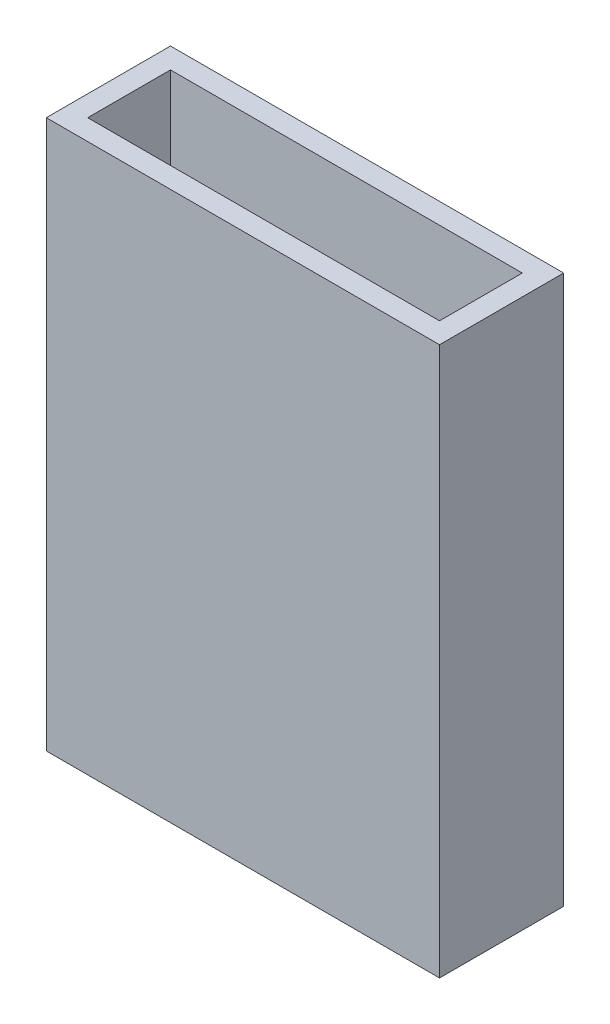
ISO-10303-21;
HEADER;
FILE_DESCRIPTION(('STEP AP214'),'2;1');
FILE_NAME('part.step','',(''),(''),'','','');
FILE_SCHEMA(('AUTOMOTIVE_DESIGN { 1 0 10303 214 1 1 1 1 }'));
ENDSEC;
DATA;
#1=APPLICATION_CONTEXT('core data for automotive mechanical design processes');
#2=APPLICATION_PROTOCOL_DEFINITION('international standard','automotive_design',2000,#1);
#3=PRODUCT_CONTEXT('',#1,'mechanical');
#4=PRODUCT('Part','Part','',(#3));
#5=PRODUCT_RELATED_PRODUCT_CATEGORY('part','',(#4));
#6=PRODUCT_DEFINITION_FORMATION('','',#4);
#7=PRODUCT_DEFINITION_CONTEXT('part definition',#1,'design');
#8=PRODUCT_DEFINITION('design','',#6,#7);
#9=PRODUCT_DEFINITION_SHAPE('','',#8);
#10=(LENGTH_UNIT() NAMED_UNIT(*) SI_UNIT(.MILLI.,.METRE.));
#11=(NAMED_UNIT(*) PLANE_ANGLE_UNIT() SI_UNIT($,.RADIAN.));
#12=(NAMED_UNIT(*) SI_UNIT($,.STERADIAN.) SOLID_ANGLE_UNIT());
#13=UNCERTAINTY_MEASURE_WITH_UNIT(LENGTH_MEASURE(1.E-05),#10,'distance_accuracy_value','');
#14=(GEOMETRIC_REPRESENTATION_CONTEXT(3) GLOBAL_UNCERTAINTY_ASSIGNED_CONTEXT((#13)) GLOBAL_UNIT_ASSIGNED_CONTEXT((#10,
#11,#12)) REPRESENTATION_CONTEXT('',''));
#15=CARTESIAN_POINT('',(0.,0.,0.));
#16=DIRECTION('',(0.,0.,1.));
#17=DIRECTION('',(1.,0.,0.));
#18=AXIS2_PLACEMENT_3D('',#15,#16,#17);
#19=CARTESIAN_POINT('',(-19.,3.,6.));
#20=DIRECTION('',(1.,0.,0.));
#21=DIRECTION('',(0.,0.,-1.));
#22=AXIS2_PLACEMENT_3D('',#19,#20,#21);
#23=PLANE('',#22);
#24=DIRECTION('',(0.,0.,1.));
#25=VECTOR('',#24,1.);
#26=CARTESIAN_POINT('',(-19.,0.,6.));
#27=LINE('',#26,#25);
#28=CARTESIAN_POINT('',(-19.,0.,-6.));
#29=VERTEX_POINT('',#28);
#30=CARTESIAN_POINT('',(-19.,0.,6.));
#31=VERTEX_POINT('',#30);
#32=EDGE_CURVE('E147',#29,#31,#27,.T.);
#33=ORIENTED_EDGE('',*,*,#32,.T.);
#34=DIRECTION('',(0.,-1.,0.));
#35=VECTOR('',#34,1.);
#36=CARTESIAN_POINT('',(-19.,3.,6.));
#37=LINE('',#36,#35);
#38=CARTESIAN_POINT('',(-19.,53.,6.));
#39=VERTEX_POINT('',#38);
#40=EDGE_CURVE('E11',#39,#31,#37,.T.);
#41=ORIENTED_EDGE('',*,*,#40,.F.);
#42=DIRECTION('',(0.,0.,1.));
#43=VECTOR('',#42,1.);
#44=CARTESIAN_POINT('',(-19.,53.,-6.));
#45=LINE('',#44,#43);
#46=CARTESIAN_POINT('',(-19.,53.,-6.));
#47=VERTEX_POINT('',#46);
#48=EDGE_CURVE('E138',#47,#39,#45,.T.);
#49=ORIENTED_EDGE('',*,*,#48,.F.);
#50=DIRECTION('',(0.,-1.,0.));
#51=VECTOR('',#50,1.);
#52=CARTESIAN_POINT('',(-19.,3.,-6.));
#53=LINE('',#52,#51);
#54=EDGE_CURVE('E156',#47,#29,#53,.T.);
#55=ORIENTED_EDGE('',*,*,#54,.T.);
#56=EDGE_LOOP('',(#33,#41,#49,#55));
#57=FACE_BOUND('',#56,.T.);
#58=ADVANCED_FACE('F33',(#57),#23,.F.);
#59=CARTESIAN_POINT('',(19.,3.,6.));
#60=DIRECTION('',(0.,0.,-1.));
#61=DIRECTION('',(-1.,0.,0.));
#62=AXIS2_PLACEMENT_3D('',#59,#60,#61);
#63=PLANE('',#62);
#64=DIRECTION('',(1.,0.,0.));
#65=VECTOR('',#64,1.);
#66=CARTESIAN_POINT('',(19.,0.,6.));
#67=LINE('',#66,#65);
#68=CARTESIAN_POINT('',(19.,0.,6.));
#69=VERTEX_POINT('',#68);
#70=EDGE_CURVE('E150',#31,#69,#67,.T.);
#71=ORIENTED_EDGE('',*,*,#70,.T.);
#72=DIRECTION('',(0.,-1.,0.));
#73=VECTOR('',#72,1.);
#74=CARTESIAN_POINT('',(19.,3.,6.));
#75=LINE('',#74,#73);
#76=CARTESIAN_POINT('',(19.,53.,6.));
#77=VERTEX_POINT('',#76);
#78=EDGE_CURVE('E41',#77,#69,#75,.T.);
#79=ORIENTED_EDGE('',*,*,#78,.F.);
#80=DIRECTION('',(1.,0.,0.));
#81=VECTOR('',#80,1.);
#82=CARTESIAN_POINT('',(-19.,53.,6.));
#83=LINE('',#82,#81);
#84=EDGE_CURVE('E141',#39,#77,#83,.T.);
#85=ORIENTED_EDGE('',*,*,#84,.F.);
#86=ORIENTED_EDGE('',*,*,#40,.T.);
#87=EDGE_LOOP('',(#71,#79,#85,#86));
#88=FACE_BOUND('',#87,.T.);
#89=ADVANCED_FACE('F196',(#88),#63,.F.);
#90=CARTESIAN_POINT('',(19.,3.,6.));
#91=DIRECTION('',(-1.,0.,0.));
#92=DIRECTION('',(0.,0.,1.));
#93=AXIS2_PLACEMENT_3D('',#90,#91,#92);
#94=PLANE('',#93);
#95=DIRECTION('',(0.,0.,-1.));
#96=VECTOR('',#95,1.);
#97=CARTESIAN_POINT('',(19.,0.,6.));
#98=LINE('',#97,#96);
#99=CARTESIAN_POINT('',(19.,0.,-6.));
#100=VERTEX_POINT('',#99);
#101=EDGE_CURVE('E152',#69,#100,#98,.T.);
#102=ORIENTED_EDGE('',*,*,#101,.T.);
#103=DIRECTION('',(0.,-1.,0.));
#104=VECTOR('',#103,1.);
#105=CARTESIAN_POINT('',(19.,3.,-6.));
#106=LINE('',#105,#104);
#107=CARTESIAN_POINT('',(19.,53.,-6.));
#108=VERTEX_POINT('',#107);
#109=EDGE_CURVE('E159',#108,#100,#106,.T.);
#110=ORIENTED_EDGE('',*,*,#109,.F.);
#111=DIRECTION('',(0.,0.,-1.));
#112=VECTOR('',#111,1.);
#113=CARTESIAN_POINT('',(19.,53.,6.));
#114=LINE('',#113,#112);
#115=EDGE_CURVE('E144',#77,#108,#114,.T.);
#116=ORIENTED_EDGE('',*,*,#115,.F.);
#117=ORIENTED_EDGE('',*,*,#78,.T.);
#118=EDGE_LOOP('',(#102,#110,#116,#117));
#119=FACE_BOUND('',#118,.T.);
#120=ADVANCED_FACE('F201',(#119),#94,.F.);
#121=CARTESIAN_POINT('',(19.,3.,-6.));
#122=DIRECTION('',(0.,0.,1.));
#123=DIRECTION('',(1.,0.,0.));
#124=AXIS2_PLACEMENT_3D('',#121,#122,#123);
#125=PLANE('',#124);
#126=DIRECTION('',(-1.,0.,0.));
#127=VECTOR('',#126,1.);
#128=CARTESIAN_POINT('',(19.,0.,-6.));
#129=LINE('',#128,#127);
#130=EDGE_CURVE('E154',#100,#29,#129,.T.);
#131=ORIENTED_EDGE('',*,*,#130,.T.);
#132=ORIENTED_EDGE('',*,*,#54,.F.);
#133=DIRECTION('',(-1.,0.,0.));
#134=VECTOR('',#133,1.);
#135=CARTESIAN_POINT('',(19.,53.,-6.));
#136=LINE('',#135,#134);
#137=EDGE_CURVE('E113',#108,#47,#136,.T.);
#138=ORIENTED_EDGE('',*,*,#137,.F.);
#139=ORIENTED_EDGE('',*,*,#109,.T.);
#140=EDGE_LOOP('',(#131,#132,#138,#139));
#141=FACE_BOUND('',#140,.T.);
#142=ADVANCED_FACE('F213',(#141),#125,.F.);
#143=CARTESIAN_POINT('',(0.,0.,0.));
#144=DIRECTION('',(0.,1.,0.));
#145=DIRECTION('',(0.,0.,1.));
#146=AXIS2_PLACEMENT_3D('',#143,#144,#145);
#147=PLANE('',#146);
#148=CARTESIAN_POINT('',(-12.5,0.,0.));
#149=DIRECTION('',(0.,1.,0.));
#150=DIRECTION('',(0.,0.,1.));
#151=AXIS2_PLACEMENT_3D('',#148,#149,#150);
#152=CIRCLE('',#151,1.5);
#153=CARTESIAN_POINT('',(-12.5,0.,1.5));
#154=VERTEX_POINT('',#153);
#155=EDGE_CURVE('E165',#154,#154,#152,.T.);
#156=ORIENTED_EDGE('',*,*,#155,.T.);
#157=EDGE_LOOP('',(#156));
#158=FACE_BOUND('',#157,.T.);
#159=CARTESIAN_POINT('',(12.5,0.,0.));
#160=DIRECTION('',(0.,1.,0.));
#161=DIRECTION('',(0.,0.,-1.));
#162=AXIS2_PLACEMENT_3D('',#159,#160,#161);
#163=CIRCLE('',#162,1.5);
#164=CARTESIAN_POINT('',(12.5,0.,-1.5));
#165=VERTEX_POINT('',#164);
#166=EDGE_CURVE('E170',#165,#165,#163,.T.);
#167=ORIENTED_EDGE('',*,*,#166,.T.);
#168=EDGE_LOOP('',(#167));
#169=FACE_BOUND('',#168,.T.);
#170=ORIENTED_EDGE('',*,*,#32,.F.);
#171=ORIENTED_EDGE('',*,*,#130,.F.);
#172=ORIENTED_EDGE('',*,*,#101,.F.);
#173=ORIENTED_EDGE('',*,*,#70,.F.);
#174=EDGE_LOOP('',(#170,#171,#172,#173));
#175=FACE_BOUND('',#174,.T.);
#176=ADVANCED_FACE('F177',(#158,#169,#175),#147,.F.);
#177=CARTESIAN_POINT('',(0.,53.,0.));
#178=DIRECTION('',(0.,1.,0.));
#179=DIRECTION('',(0.,0.,1.));
#180=AXIS2_PLACEMENT_3D('',#177,#178,#179);
#181=PLANE('',#180);
#182=ORIENTED_EDGE('',*,*,#137,.T.);
#183=ORIENTED_EDGE('',*,*,#48,.T.);
#184=ORIENTED_EDGE('',*,*,#84,.T.);
#185=ORIENTED_EDGE('',*,*,#115,.T.);
#186=EDGE_LOOP('',(#182,#183,#184,#185));
#187=FACE_BOUND('',#186,.T.);
#188=DIRECTION('',(0.,0.,1.));
#189=VECTOR('',#188,1.);
#190=CARTESIAN_POINT('',(-17.,53.,-4.));
#191=LINE('',#190,#189);
#192=CARTESIAN_POINT('',(-17.,53.,-4.));
#193=VERTEX_POINT('',#192);
#194=CARTESIAN_POINT('',(-17.,53.,4.));
#195=VERTEX_POINT('',#194);
#196=EDGE_CURVE('E107',#193,#195,#191,.T.);
#197=ORIENTED_EDGE('',*,*,#196,.F.);
#198=DIRECTION('',(-1.,0.,0.));
#199=VECTOR('',#198,1.);
#200=CARTESIAN_POINT('',(17.,53.,-4.));
#201=LINE('',#200,#199);
#202=CARTESIAN_POINT('',(17.,53.,-4.));
#203=VERTEX_POINT('',#202);
#204=EDGE_CURVE('E98',#203,#193,#201,.T.);
#205=ORIENTED_EDGE('',*,*,#204,.F.);
#206=DIRECTION('',(0.,0.,-1.));
#207=VECTOR('',#206,1.);
#208=CARTESIAN_POINT('',(17.,53.,4.));
#209=LINE('',#208,#207);
#210=CARTESIAN_POINT('',(17.,53.,4.));
#211=VERTEX_POINT('',#210);
#212=EDGE_CURVE('E121',#211,#203,#209,.T.);
#213=ORIENTED_EDGE('',*,*,#212,.F.);
#214=DIRECTION('',(1.,0.,0.));
#215=VECTOR('',#214,1.);
#216=CARTESIAN_POINT('',(-17.,53.,4.));
#217=LINE('',#216,#215);
#218=EDGE_CURVE('E119',#195,#211,#217,.T.);
#219=ORIENTED_EDGE('',*,*,#218,.F.);
#220=EDGE_LOOP('',(#197,#205,#213,#219));
#221=FACE_BOUND('',#220,.T.);
#222=ADVANCED_FACE('F117',(#187,#221),#181,.T.);
#223=CARTESIAN_POINT('',(17.,53.,-4.));
#224=DIRECTION('',(0.,0.,1.));
#225=DIRECTION('',(1.,0.,0.));
#226=AXIS2_PLACEMENT_3D('',#223,#224,#225);
#227=PLANE('',#226);
#228=DIRECTION('',(-1.,0.,0.));
#229=VECTOR('',#228,1.);
#230=CARTESIAN_POINT('',(17.,3.,-4.));
#231=LINE('',#230,#229);
#232=CARTESIAN_POINT('',(17.,3.,-4.));
#233=VERTEX_POINT('',#232);
#234=CARTESIAN_POINT('',(-17.,3.,-4.));
#235=VERTEX_POINT('',#234);
#236=EDGE_CURVE('E49',#233,#235,#231,.T.);
#237=ORIENTED_EDGE('',*,*,#236,.F.);
#238=DIRECTION('',(0.,-1.,0.));
#239=VECTOR('',#238,1.);
#240=CARTESIAN_POINT('',(17.,53.,-4.));
#241=LINE('',#240,#239);
#242=EDGE_CURVE('E103',#203,#233,#241,.T.);
#243=ORIENTED_EDGE('',*,*,#242,.F.);
#244=ORIENTED_EDGE('',*,*,#204,.T.);
#245=DIRECTION('',(0.,-1.,0.));
#246=VECTOR('',#245,1.);
#247=CARTESIAN_POINT('',(-17.,53.,-4.));
#248=LINE('',#247,#246);
#249=EDGE_CURVE('E101',#193,#235,#248,.T.);
#250=ORIENTED_EDGE('',*,*,#249,.T.);
#251=EDGE_LOOP('',(#237,#243,#244,#250));
#252=FACE_BOUND('',#251,.T.);
#253=ADVANCED_FACE('F100',(#252),#227,.T.);
#254=CARTESIAN_POINT('',(-17.,53.,-4.));
#255=DIRECTION('',(1.,0.,0.));
#256=DIRECTION('',(0.,0.,-1.));
#257=AXIS2_PLACEMENT_3D('',#254,#255,#256);
#258=PLANE('',#257);
#259=DIRECTION('',(0.,0.,1.));
#260=VECTOR('',#259,1.);
#261=CARTESIAN_POINT('',(-17.,3.,-4.));
#262=LINE('',#261,#260);
#263=CARTESIAN_POINT('',(-17.,3.,4.));
#264=VERTEX_POINT('',#263);
#265=EDGE_CURVE('E53',#235,#264,#262,.T.);
#266=ORIENTED_EDGE('',*,*,#265,.F.);
#267=ORIENTED_EDGE('',*,*,#249,.F.);
#268=ORIENTED_EDGE('',*,*,#196,.T.);
#269=DIRECTION('',(0.,-1.,0.));
#270=VECTOR('',#269,1.);
#271=CARTESIAN_POINT('',(-17.,53.,4.));
#272=LINE('',#271,#270);
#273=EDGE_CURVE('E114',#195,#264,#272,.T.);
#274=ORIENTED_EDGE('',*,*,#273,.T.);
#275=EDGE_LOOP('',(#266,#267,#268,#274));
#276=FACE_BOUND('',#275,.T.);
#277=ADVANCED_FACE('F111',(#276),#258,.T.);
#278=CARTESIAN_POINT('',(-17.,53.,4.));
#279=DIRECTION('',(0.,0.,-1.));
#280=DIRECTION('',(-1.,0.,0.));
#281=AXIS2_PLACEMENT_3D('',#278,#279,#280);
#282=PLANE('',#281);
#283=DIRECTION('',(1.,0.,0.));
#284=VECTOR('',#283,1.);
#285=CARTESIAN_POINT('',(-17.,3.,4.));
#286=LINE('',#285,#284);
#287=CARTESIAN_POINT('',(17.,3.,4.));
#288=VERTEX_POINT('',#287);
#289=EDGE_CURVE('E128',#264,#288,#286,.T.);
#290=ORIENTED_EDGE('',*,*,#289,.F.);
#291=ORIENTED_EDGE('',*,*,#273,.F.);
#292=ORIENTED_EDGE('',*,*,#218,.T.);
#293=DIRECTION('',(0.,-1.,0.));
#294=VECTOR('',#293,1.);
#295=CARTESIAN_POINT('',(17.,53.,4.));
#296=LINE('',#295,#294);
#297=EDGE_CURVE('E132',#211,#288,#296,.T.);
#298=ORIENTED_EDGE('',*,*,#297,.T.);
#299=EDGE_LOOP('',(#290,#291,#292,#298));
#300=FACE_BOUND('',#299,.T.);
#301=ADVANCED_FACE('F229',(#300),#282,.T.);
#302=CARTESIAN_POINT('',(17.,53.,4.));
#303=DIRECTION('',(-1.,0.,0.));
#304=DIRECTION('',(0.,0.,1.));
#305=AXIS2_PLACEMENT_3D('',#302,#303,#304);
#306=PLANE('',#305);
#307=DIRECTION('',(0.,0.,-1.));
#308=VECTOR('',#307,1.);
#309=CARTESIAN_POINT('',(17.,3.,4.));
#310=LINE('',#309,#308);
#311=EDGE_CURVE('E108',#288,#233,#310,.T.);
#312=ORIENTED_EDGE('',*,*,#311,.F.);
#313=ORIENTED_EDGE('',*,*,#297,.F.);
#314=ORIENTED_EDGE('',*,*,#212,.T.);
#315=ORIENTED_EDGE('',*,*,#242,.T.);
#316=EDGE_LOOP('',(#312,#313,#314,#315));
#317=FACE_BOUND('',#316,.T.);
#318=ADVANCED_FACE('F191',(#317),#306,.T.);
#319=CARTESIAN_POINT('',(0.,3.,0.));
#320=DIRECTION('',(0.,1.,0.));
#321=DIRECTION('',(0.,0.,1.));
#322=AXIS2_PLACEMENT_3D('',#319,#320,#321);
#323=PLANE('',#322);
#324=CARTESIAN_POINT('',(-12.5,3.,0.));
#325=DIRECTION('',(0.,1.,0.));
#326=DIRECTION('',(0.,0.,1.));
#327=AXIS2_PLACEMENT_3D('',#324,#325,#326);
#328=CIRCLE('',#327,1.5);
#329=CARTESIAN_POINT('',(-12.5,3.,1.5));
#330=VERTEX_POINT('',#329);
#331=EDGE_CURVE('E36',#330,#330,#328,.T.);
#332=ORIENTED_EDGE('',*,*,#331,.F.);
#333=EDGE_LOOP('',(#332));
#334=FACE_BOUND('',#333,.T.);
#335=CARTESIAN_POINT('',(12.5,3.,0.));
#336=DIRECTION('',(0.,1.,0.));
#337=DIRECTION('',(0.,0.,1.));
#338=AXIS2_PLACEMENT_3D('',#335,#336,#337);
#339=CIRCLE('',#338,1.5);
#340=CARTESIAN_POINT('',(12.5,3.,1.49999999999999));
#341=VERTEX_POINT('',#340);
#342=EDGE_CURVE('E163',#341,#341,#339,.T.);
#343=ORIENTED_EDGE('',*,*,#342,.F.);
#344=EDGE_LOOP('',(#343));
#345=FACE_BOUND('',#344,.T.);
#346=ORIENTED_EDGE('',*,*,#236,.T.);
#347=ORIENTED_EDGE('',*,*,#265,.T.);
#348=ORIENTED_EDGE('',*,*,#289,.T.);
#349=ORIENTED_EDGE('',*,*,#311,.T.);
#350=EDGE_LOOP('',(#346,#347,#348,#349));
#351=FACE_BOUND('',#350,.T.);
#352=ADVANCED_FACE('F183',(#334,#345,#351),#323,.T.);
#353=CARTESIAN_POINT('',(12.5,0.,0.));
#354=DIRECTION('',(0.,1.,0.));
#355=DIRECTION('',(0.,0.,1.));
#356=AXIS2_PLACEMENT_3D('',#353,#354,#355);
#357=CYLINDRICAL_SURFACE('',#356,1.5);
#358=ORIENTED_EDGE('',*,*,#342,.T.);
#359=EDGE_LOOP('',(#358));
#360=FACE_BOUND('',#359,.T.);
#361=ORIENTED_EDGE('',*,*,#166,.F.);
#362=EDGE_LOOP('',(#361));
#363=FACE_BOUND('',#362,.T.);
#364=ADVANCED_FACE('F180',(#360,#363),#357,.F.);
#365=CARTESIAN_POINT('',(-12.5,0.,0.));
#366=DIRECTION('',(0.,1.,0.));
#367=DIRECTION('',(0.,0.,1.));
#368=AXIS2_PLACEMENT_3D('',#365,#366,#367);
#369=CYLINDRICAL_SURFACE('',#368,1.5);
#370=ORIENTED_EDGE('',*,*,#331,.T.);
#371=EDGE_LOOP('',(#370));
#372=FACE_BOUND('',#371,.T.);
#373=ORIENTED_EDGE('',*,*,#155,.F.);
#374=EDGE_LOOP('',(#373));
#375=FACE_BOUND('',#374,.T.);
#376=ADVANCED_FACE('F182',(#372,#375),#369,.F.);
#377=CLOSED_SHELL('',(#58,#89,#120,#142,#176,#222,#253,#277,#301,#318,#352,#364,#376));
#378=MANIFOLD_SOLID_BREP('B2',#377);
#379=ADVANCED_BREP_SHAPE_REPRESENTATION('',(#18,#378),#14);
#380=SHAPE_DEFINITION_REPRESENTATION(#9,#379);
ENDSEC;
END-ISO-10303-21;
